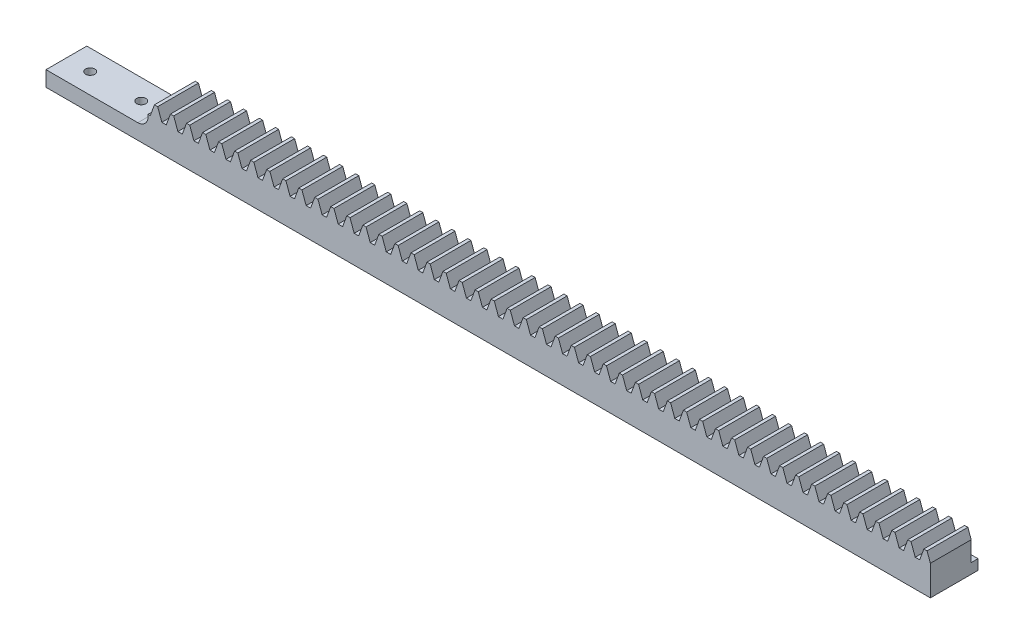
from build123d import *

# Parameters (mm, degrees)
BLANKSKE_W          = 230
BLANKSKE_H          = 11.5
BLANK_DEPTH         = 12
TOOTHCUTSIM_DEPTH   = 231.599761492
TEETHCUTS_COUNT     = 50
TEETHCUTS_PITCH     = 4.712388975
SKETCH3_W           = 208.959955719
SKETCH3_H           = 3
BOSS_EXTRUDE3_DEPTH = 2
SKETCH4_W           = 21.040044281
SKETCH4_H           = 12
BOSS_EXTRUDE4_DEPTH = 0.5
SKETCH5_W           = 12
SKETCH5_H           = 5
BOSS_EXTRUDE5_DEPTH = 30
SKETCH6_R           = 1.35
CUT_EXTRUDE1_DEPTH  = 10
FILLET7_R           = 3
SKETCH7_W           = 9
SKETCH7_H           = 0.5
CUT_EXTRUDE3_DEPTH  = 20
SKETCH8_W           = 2
SKETCH8_H           = 3
BOSS_EXTRUDE6_DEPTH = 9
SKETCH9_W           = 42.040044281
SKETCH9_H           = 0.5
CUT_EXTRUDE6_DEPTH  = 15


with BuildPart() as part:
    # BlankSke → Blank (new body)
    with BuildSketch(Plane.XY):
        with Locations((115, 5.75)):
            Rectangle(BLANKSKE_W, BLANKSKE_H)
    extrude(amount=-BLANK_DEPTH)

    # TooCutSkeSim → ToothCutSim (cut, through all)
    with BuildSketch(Plane.XY):
        Polygon((0.654653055, 8.125), (-0.654653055, 8.125), (-1.892297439, 11.5254), (1.892297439, 11.5254), align=None)
    toothcutsim = extrude(amount=-TOOTHCUTSIM_DEPTH, mode=Mode.SUBTRACT)

    # TeethCuts: ToothCutSim ×50
    with Locations(*[(i * TEETHCUTS_PITCH, 0, 0) for i in range(1, TEETHCUTS_COUNT)]):
        add(toothcutsim, mode=Mode.SUBTRACT)

    # Sketch3 → Boss-Extrude3 (add)
    with BuildSketch(Plane(origin=(0, 0, -12), x_dir=(-1, 0, 0), z_dir=(0, 0, -1))):
        with Locations((-125.520022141, 1.5)):
            Rectangle(SKETCH3_W, SKETCH3_H)
    extrude(amount=BOSS_EXTRUDE3_DEPTH)

    # Sketch4 → Boss-Extrude4 (add)
    with BuildSketch(Plane.XZ):
        with Locations((10.520022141, -6)):
            Rectangle(SKETCH4_W, SKETCH4_H)
    extrude(amount=BOSS_EXTRUDE4_DEPTH)

    # Sketch5 → Boss-Extrude5 (add)
    with BuildSketch(Plane.ZY):
        with Locations((-6, 2)):
            Rectangle(SKETCH5_W, SKETCH5_H)
    extrude(amount=BOSS_EXTRUDE5_DEPTH)

    # Sketch6 → Cut-Extrude1 (cut)
    with BuildSketch(Plane(origin=(0, 4.5, 0), x_dir=(1, 0, 0), z_dir=(0, 1, 0))):
        with Locations(Location((-8, 6, 0), (0, 0, 270))):
            Circle(SKETCH6_R)
        with Locations(Location((-23, 6, 0), (0, 0, 270))):
            Circle(SKETCH6_R)
    extrude(amount=-CUT_EXTRUDE1_DEPTH, mode=Mode.SUBTRACT)

    # Fillet7
    fillet7_edges = [part.edges().sort_by_distance(p)[0] for p in [
        (0, 4.5, -6),
    ]]
    fillet(fillet7_edges, radius=FILLET7_R)

    # Sketch7 → Cut-Extrude3 (cut)
    with BuildSketch(Plane(origin=(0, 0, -12), x_dir=(-1, 0, 0), z_dir=(0, 0, -1))):
        with Locations((-16.540044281, -0.25)):
            Rectangle(SKETCH7_W, SKETCH7_H)
    extrude(amount=-CUT_EXTRUDE3_DEPTH, mode=Mode.SUBTRACT)

    # Sketch8 → Boss-Extrude6 (add)
    with BuildSketch(Plane.ZY.offset(-21.040044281)):
        with Locations((-13, 1.5)):
            Rectangle(SKETCH8_W, SKETCH8_H)
    extrude(amount=BOSS_EXTRUDE6_DEPTH)

    # Sketch9 → Cut-Extrude6 (cut)
    with BuildSketch(Plane(origin=(0, 0, -12), x_dir=(-1, 0, 0), z_dir=(0, 0, -1))):
        with Locations((8.97997786, -0.25)):
            Rectangle(SKETCH9_W, SKETCH9_H)
    extrude(amount=-CUT_EXTRUDE6_DEPTH, mode=Mode.SUBTRACT)


solid = part.part
